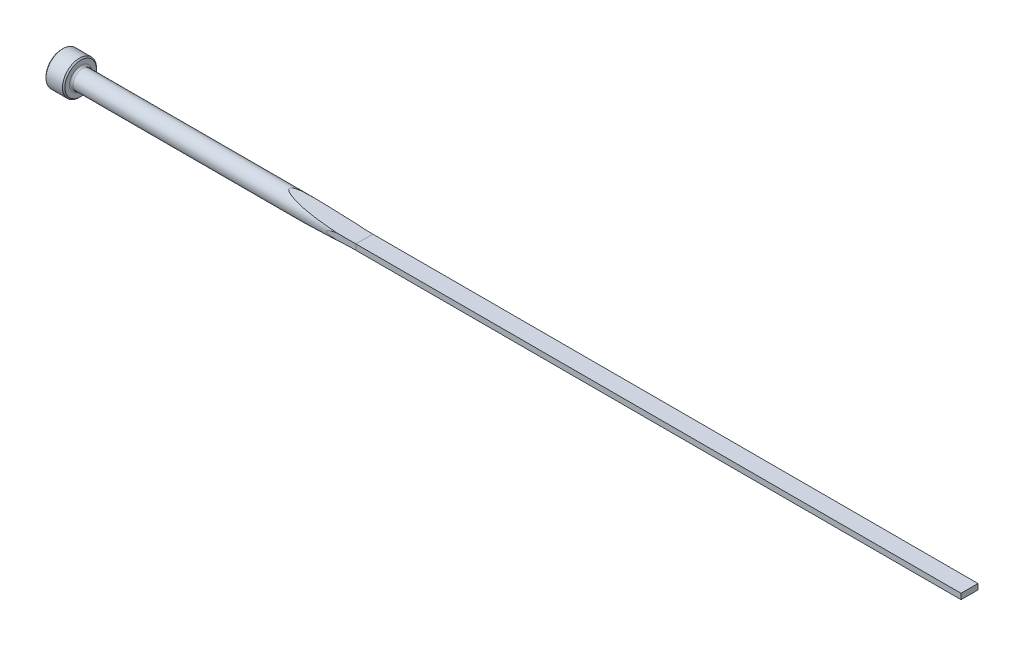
from build123d import *

# Parameters (mm, degrees)
CUT_EXTRUDE1_DEPTH = 191.56684192
CUT_EXTRUDE2_DEPTH = 191.56684202
FILLET1_R          = 0.381
CHAMFER1_SIZE      = 0.254


with BuildPart() as part:
    # Sketch1 → Revolve1 (revolve)
    with BuildSketch(Plane.XY, mode=Mode.PRIVATE) as revolve1_sk:
        Polygon((0, 0), (0, 3.5687), (3.9624, 3.5687), (3.9624, 1.9812), (190.5, 1.9812), (190.5, 0), align=None)
    revolve(revolve1_sk.sketch.rotate(Axis((0, 0, 0), (1, 0, 0)), 90), axis=Axis((0, 0, 0), (1, 0, 0)))

    # Sketch2 → Cut-Extrude1 (cut, symmetric)
    with BuildSketch(Plane.XY):
        with BuildLine():
            Line((190.5, 1.9812), (190.5, 0.5842))
            Line((190.5, 0.5842), (63.5, 0.5842))
            ThreePointArc((63.5, 0.5842), (55.619857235, 0.934138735), (47.801751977, 1.9812))
            Line((47.801751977, 1.9812), (190.5, 1.9812))
        make_face()
    cut_extrude1 = extrude(amount=CUT_EXTRUDE1_DEPTH, both=True, mode=Mode.SUBTRACT)

    # Mirror1: Cut-Extrude1 across plane
    add(cut_extrude1.mirror(Plane.ZX), mode=Mode.SUBTRACT)

    # Sketch3 → Cut-Extrude2 (cut, symmetric)
    with BuildSketch(Plane(origin=(0, 0, 0), x_dir=(1, 0, 0), z_dir=(0, 1, 0))):
        with BuildLine():
            Line((190.5, 1.9812), (190.5, 1.778))
            Line((190.5, 1.778), (63.5, 1.778))
            ThreePointArc((63.5, 1.778), (60.49463147, 1.828814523), (57.492698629, 1.9812))
            Line((57.492698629, 1.9812), (190.5, 1.9812))
        make_face()
    cut_extrude2 = extrude(amount=CUT_EXTRUDE2_DEPTH, both=True, mode=Mode.SUBTRACT)

    # Mirror2: Cut-Extrude2 across plane
    add(cut_extrude2.mirror(Plane.XY), mode=Mode.SUBTRACT)

    # Fillet1
    fillet1_edges = [part.edges().sort_by_distance(p)[0] for p in [
        (3.9624, 0, -1.9812),
    ]]
    fillet(fillet1_edges, radius=FILLET1_R)

    # Chamfer1
    chamfer1_edges = [part.edges().sort_by_distance(p)[0] for p in [
        (3.9624, 0, -3.5687),
        (0, 0, -3.5687),
    ]]
    chamfer(chamfer1_edges, length=CHAMFER1_SIZE)


solid = part.part
